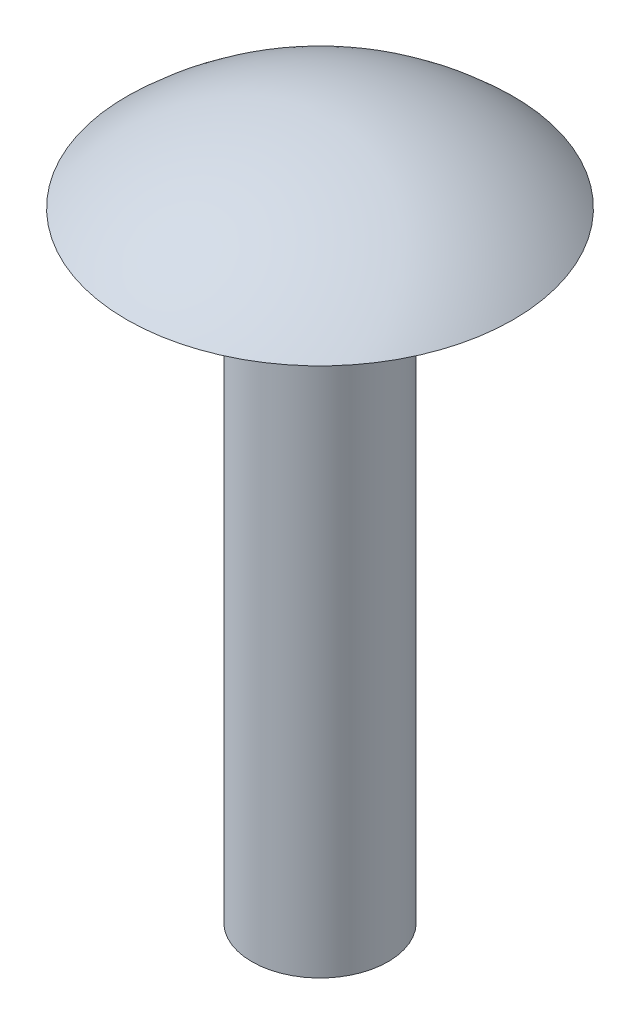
ISO-10303-21;
HEADER;
FILE_DESCRIPTION(('STEP AP214'),'2;1');
FILE_NAME('part.step','',(''),(''),'','','');
FILE_SCHEMA(('AUTOMOTIVE_DESIGN { 1 0 10303 214 1 1 1 1 }'));
ENDSEC;
DATA;
#1=APPLICATION_CONTEXT('core data for automotive mechanical design processes');
#2=APPLICATION_PROTOCOL_DEFINITION('international standard','automotive_design',2000,#1);
#3=PRODUCT_CONTEXT('',#1,'mechanical');
#4=PRODUCT('Part','Part','',(#3));
#5=PRODUCT_RELATED_PRODUCT_CATEGORY('part','',(#4));
#6=PRODUCT_DEFINITION_FORMATION('','',#4);
#7=PRODUCT_DEFINITION_CONTEXT('part definition',#1,'design');
#8=PRODUCT_DEFINITION('design','',#6,#7);
#9=PRODUCT_DEFINITION_SHAPE('','',#8);
#10=(LENGTH_UNIT() NAMED_UNIT(*) SI_UNIT(.MILLI.,.METRE.));
#11=(NAMED_UNIT(*) PLANE_ANGLE_UNIT() SI_UNIT($,.RADIAN.));
#12=(NAMED_UNIT(*) SI_UNIT($,.STERADIAN.) SOLID_ANGLE_UNIT());
#13=UNCERTAINTY_MEASURE_WITH_UNIT(LENGTH_MEASURE(1.E-05),#10,'distance_accuracy_value','');
#14=(GEOMETRIC_REPRESENTATION_CONTEXT(3) GLOBAL_UNCERTAINTY_ASSIGNED_CONTEXT((#13)) GLOBAL_UNIT_ASSIGNED_CONTEXT((#10,
#11,#12)) REPRESENTATION_CONTEXT('',''));
#15=CARTESIAN_POINT('',(0.,0.,0.));
#16=DIRECTION('',(0.,0.,1.));
#17=DIRECTION('',(1.,0.,0.));
#18=AXIS2_PLACEMENT_3D('',#15,#16,#17);
#19=CARTESIAN_POINT('',(0.,-4.1671875,0.));
#20=DIRECTION('',(0.,1.,0.));
#21=DIRECTION('',(1.,0.,0.));
#22=AXIS2_PLACEMENT_3D('',#19,#20,#21);
#23=SPHERICAL_SURFACE('',#22,5.7546875);
#24=CARTESIAN_POINT('',(0.,0.,0.));
#25=DIRECTION('',(0.,1.,0.));
#26=DIRECTION('',(0.,0.,1.));
#27=AXIS2_PLACEMENT_3D('',#24,#25,#26);
#28=CIRCLE('',#27,3.96875);
#29=CARTESIAN_POINT('',(0.,0.,3.96875));
#30=VERTEX_POINT('',#29);
#31=EDGE_CURVE('E44',#30,#30,#28,.T.);
#32=ORIENTED_EDGE('',*,*,#31,.T.);
#33=EDGE_LOOP('',(#32));
#34=FACE_BOUND('',#33,.T.);
#35=ADVANCED_FACE('F34',(#34),#23,.T.);
#36=CARTESIAN_POINT('',(1.397,-12.7,0.));
#37=DIRECTION('',(0.,1.,0.));
#38=DIRECTION('',(0.,0.,1.));
#39=AXIS2_PLACEMENT_3D('',#36,#37,#38);
#40=PLANE('',#39);
#41=CARTESIAN_POINT('',(0.,-12.7,0.));
#42=DIRECTION('',(0.,1.,0.));
#43=DIRECTION('',(0.,0.,1.));
#44=AXIS2_PLACEMENT_3D('',#41,#42,#43);
#45=CIRCLE('',#44,1.397);
#46=CARTESIAN_POINT('',(0.,-12.7,1.397));
#47=VERTEX_POINT('',#46);
#48=EDGE_CURVE('E10',#47,#47,#45,.T.);
#49=ORIENTED_EDGE('',*,*,#48,.F.);
#50=EDGE_LOOP('',(#49));
#51=FACE_BOUND('',#50,.T.);
#52=ADVANCED_FACE('F59',(#51),#40,.F.);
#53=CARTESIAN_POINT('',(0.,3.53203184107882,0.));
#54=DIRECTION('',(0.,1.,0.));
#55=DIRECTION('',(0.,0.,1.));
#56=AXIS2_PLACEMENT_3D('',#53,#54,#55);
#57=CYLINDRICAL_SURFACE('',#56,1.397);
#58=CARTESIAN_POINT('',(0.,0.,0.));
#59=DIRECTION('',(0.,1.,0.));
#60=DIRECTION('',(0.,0.,1.));
#61=AXIS2_PLACEMENT_3D('',#58,#59,#60);
#62=CIRCLE('',#61,1.39699999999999);
#63=CARTESIAN_POINT('',(0.,0.,1.39699999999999));
#64=VERTEX_POINT('',#63);
#65=EDGE_CURVE('E40',#64,#64,#62,.T.);
#66=ORIENTED_EDGE('',*,*,#65,.F.);
#67=EDGE_LOOP('',(#66));
#68=FACE_BOUND('',#67,.T.);
#69=ORIENTED_EDGE('',*,*,#48,.T.);
#70=EDGE_LOOP('',(#69));
#71=FACE_BOUND('',#70,.T.);
#72=ADVANCED_FACE('F54',(#68,#71),#57,.T.);
#73=CARTESIAN_POINT('',(1.39699999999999,0.,0.));
#74=DIRECTION('',(0.,1.,0.));
#75=DIRECTION('',(0.,0.,1.));
#76=AXIS2_PLACEMENT_3D('',#73,#74,#75);
#77=PLANE('',#76);
#78=ORIENTED_EDGE('',*,*,#31,.F.);
#79=EDGE_LOOP('',(#78));
#80=FACE_BOUND('',#79,.T.);
#81=ORIENTED_EDGE('',*,*,#65,.T.);
#82=EDGE_LOOP('',(#81));
#83=FACE_BOUND('',#82,.T.);
#84=ADVANCED_FACE('F52',(#80,#83),#77,.F.);
#85=CLOSED_SHELL('',(#35,#52,#72,#84));
#86=MANIFOLD_SOLID_BREP('B2',#85);
#87=ADVANCED_BREP_SHAPE_REPRESENTATION('',(#18,#86),#14);
#88=SHAPE_DEFINITION_REPRESENTATION(#9,#87);
ENDSEC;
END-ISO-10303-21;
